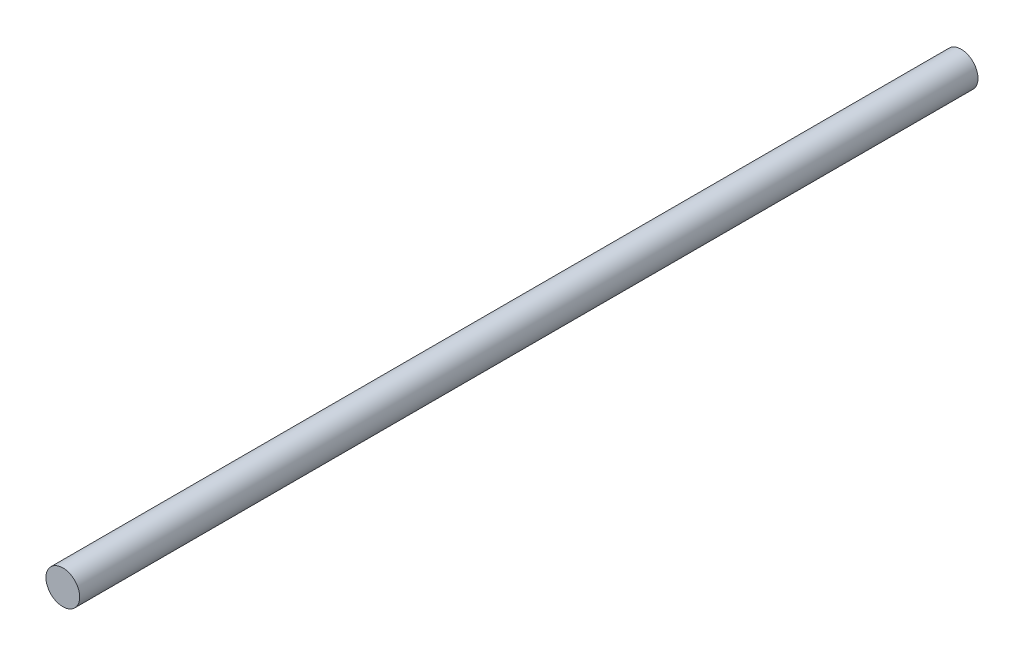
from build123d import *

# Parameters (mm, degrees)
SKETCH3_R           = 1.5875
BOSS_EXTRUDE1_DEPTH = 42.299999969


with BuildPart() as part:
    # Sketch3 → Boss-Extrude1 (new, symmetric)
    with BuildSketch(Plane.XY):
        Circle(SKETCH3_R)
    extrude(amount=BOSS_EXTRUDE1_DEPTH, both=True)


solid = part.part
